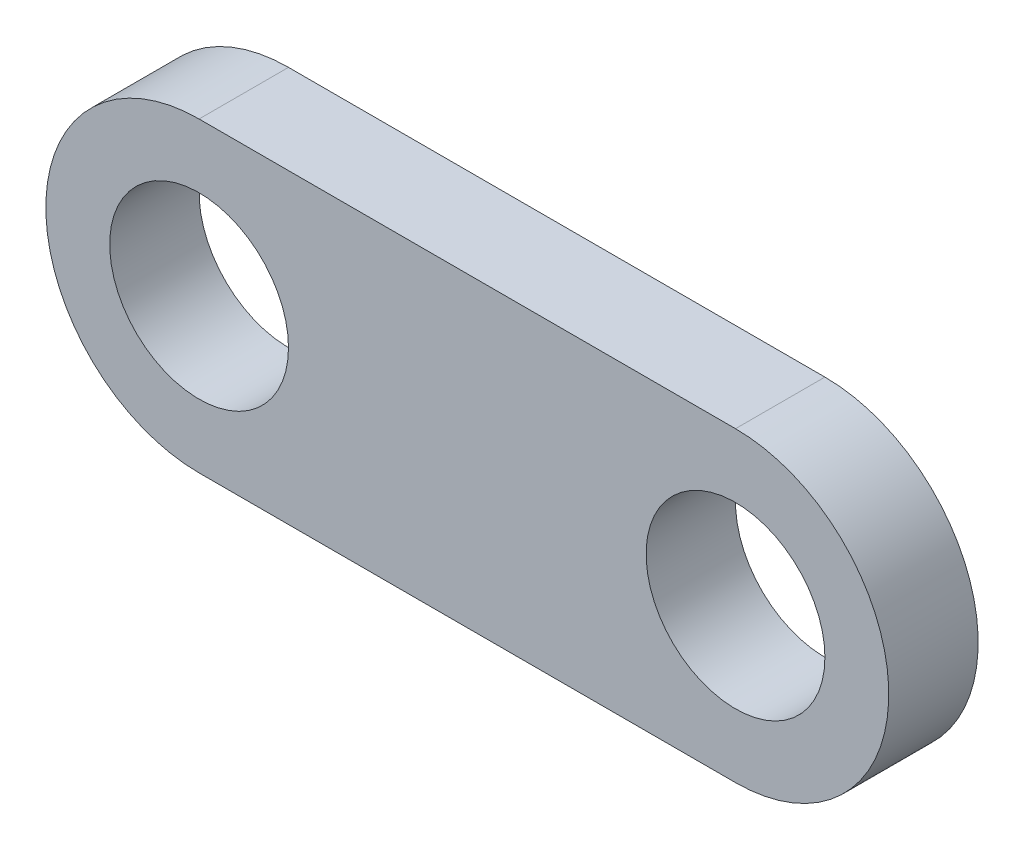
ISO-10303-21;
HEADER;
FILE_DESCRIPTION(('STEP AP214'),'2;1');
FILE_NAME('part.step','',(''),(''),'','','');
FILE_SCHEMA(('AUTOMOTIVE_DESIGN { 1 0 10303 214 1 1 1 1 }'));
ENDSEC;
DATA;
#1=APPLICATION_CONTEXT('core data for automotive mechanical design processes');
#2=APPLICATION_PROTOCOL_DEFINITION('international standard','automotive_design',2000,#1);
#3=PRODUCT_CONTEXT('',#1,'mechanical');
#4=PRODUCT('Part','Part','',(#3));
#5=PRODUCT_RELATED_PRODUCT_CATEGORY('part','',(#4));
#6=PRODUCT_DEFINITION_FORMATION('','',#4);
#7=PRODUCT_DEFINITION_CONTEXT('part definition',#1,'design');
#8=PRODUCT_DEFINITION('design','',#6,#7);
#9=PRODUCT_DEFINITION_SHAPE('','',#8);
#10=(LENGTH_UNIT() NAMED_UNIT(*) SI_UNIT(.MILLI.,.METRE.));
#11=(NAMED_UNIT(*) PLANE_ANGLE_UNIT() SI_UNIT($,.RADIAN.));
#12=(NAMED_UNIT(*) SI_UNIT($,.STERADIAN.) SOLID_ANGLE_UNIT());
#13=UNCERTAINTY_MEASURE_WITH_UNIT(LENGTH_MEASURE(1.E-05),#10,'distance_accuracy_value','');
#14=(GEOMETRIC_REPRESENTATION_CONTEXT(3) GLOBAL_UNCERTAINTY_ASSIGNED_CONTEXT((#13)) GLOBAL_UNIT_ASSIGNED_CONTEXT((#10,
#11,#12)) REPRESENTATION_CONTEXT('',''));
#15=CARTESIAN_POINT('',(0.,0.,0.));
#16=DIRECTION('',(0.,0.,1.));
#17=DIRECTION('',(1.,0.,0.));
#18=AXIS2_PLACEMENT_3D('',#15,#16,#17);
#19=CARTESIAN_POINT('',(0.,0.,7.));
#20=DIRECTION('',(0.,0.,-1.));
#21=DIRECTION('',(-1.,0.,0.));
#22=AXIS2_PLACEMENT_3D('',#19,#20,#21);
#23=CYLINDRICAL_SURFACE('',#22,12.);
#24=CARTESIAN_POINT('',(0.,0.,0.));
#25=DIRECTION('',(0.,0.,-1.));
#26=DIRECTION('',(-1.,0.,0.));
#27=AXIS2_PLACEMENT_3D('',#24,#25,#26);
#28=CIRCLE('',#27,12.);
#29=CARTESIAN_POINT('',(0.,-12.,0.));
#30=VERTEX_POINT('',#29);
#31=CARTESIAN_POINT('',(0.,12.,0.));
#32=VERTEX_POINT('',#31);
#33=EDGE_CURVE('E75',#30,#32,#28,.T.);
#34=ORIENTED_EDGE('',*,*,#33,.F.);
#35=DIRECTION('',(0.,0.,-1.));
#36=VECTOR('',#35,1.);
#37=CARTESIAN_POINT('',(0.,-12.,7.));
#38=LINE('',#37,#36);
#39=CARTESIAN_POINT('',(0.,-12.,7.));
#40=VERTEX_POINT('',#39);
#41=EDGE_CURVE('E11',#40,#30,#38,.T.);
#42=ORIENTED_EDGE('',*,*,#41,.F.);
#43=CARTESIAN_POINT('',(0.,0.,7.));
#44=DIRECTION('',(0.,0.,-1.));
#45=DIRECTION('',(-1.,0.,0.));
#46=AXIS2_PLACEMENT_3D('',#43,#44,#45);
#47=CIRCLE('',#46,12.);
#48=CARTESIAN_POINT('',(0.,12.,7.));
#49=VERTEX_POINT('',#48);
#50=EDGE_CURVE('E77',#40,#49,#47,.T.);
#51=ORIENTED_EDGE('',*,*,#50,.T.);
#52=DIRECTION('',(0.,0.,-1.));
#53=VECTOR('',#52,1.);
#54=CARTESIAN_POINT('',(0.,12.,7.));
#55=LINE('',#54,#53);
#56=EDGE_CURVE('E38',#49,#32,#55,.T.);
#57=ORIENTED_EDGE('',*,*,#56,.T.);
#58=EDGE_LOOP('',(#34,#42,#51,#57));
#59=FACE_BOUND('',#58,.T.);
#60=ADVANCED_FACE('F35',(#59),#23,.T.);
#61=CARTESIAN_POINT('',(42.,-12.,7.));
#62=DIRECTION('',(0.,-1.,0.));
#63=DIRECTION('',(0.,0.,-1.));
#64=AXIS2_PLACEMENT_3D('',#61,#62,#63);
#65=PLANE('',#64);
#66=DIRECTION('',(-1.,0.,0.));
#67=VECTOR('',#66,1.);
#68=CARTESIAN_POINT('',(42.,-12.,0.));
#69=LINE('',#68,#67);
#70=CARTESIAN_POINT('',(42.,-12.,0.));
#71=VERTEX_POINT('',#70);
#72=EDGE_CURVE('E92',#71,#30,#69,.T.);
#73=ORIENTED_EDGE('',*,*,#72,.F.);
#74=DIRECTION('',(0.,0.,-1.));
#75=VECTOR('',#74,1.);
#76=CARTESIAN_POINT('',(42.,-12.,7.));
#77=LINE('',#76,#75);
#78=CARTESIAN_POINT('',(42.,-12.,7.));
#79=VERTEX_POINT('',#78);
#80=EDGE_CURVE('E43',#79,#71,#77,.T.);
#81=ORIENTED_EDGE('',*,*,#80,.F.);
#82=DIRECTION('',(-1.,0.,0.));
#83=VECTOR('',#82,1.);
#84=CARTESIAN_POINT('',(42.,-12.,7.));
#85=LINE('',#84,#83);
#86=EDGE_CURVE('E82',#79,#40,#85,.T.);
#87=ORIENTED_EDGE('',*,*,#86,.T.);
#88=ORIENTED_EDGE('',*,*,#41,.T.);
#89=EDGE_LOOP('',(#73,#81,#87,#88));
#90=FACE_BOUND('',#89,.T.);
#91=ADVANCED_FACE('F112',(#90),#65,.T.);
#92=CARTESIAN_POINT('',(42.,0.,7.));
#93=DIRECTION('',(0.,0.,-1.));
#94=DIRECTION('',(-1.,0.,0.));
#95=AXIS2_PLACEMENT_3D('',#92,#93,#94);
#96=CYLINDRICAL_SURFACE('',#95,12.);
#97=CARTESIAN_POINT('',(42.,0.,0.));
#98=DIRECTION('',(0.,0.,-1.));
#99=DIRECTION('',(-1.,0.,0.));
#100=AXIS2_PLACEMENT_3D('',#97,#98,#99);
#101=CIRCLE('',#100,12.);
#102=CARTESIAN_POINT('',(42.,12.,0.));
#103=VERTEX_POINT('',#102);
#104=EDGE_CURVE('E89',#103,#71,#101,.T.);
#105=ORIENTED_EDGE('',*,*,#104,.F.);
#106=DIRECTION('',(0.,0.,-1.));
#107=VECTOR('',#106,1.);
#108=CARTESIAN_POINT('',(42.,12.,7.));
#109=LINE('',#108,#107);
#110=CARTESIAN_POINT('',(42.,12.,7.));
#111=VERTEX_POINT('',#110);
#112=EDGE_CURVE('E81',#111,#103,#109,.T.);
#113=ORIENTED_EDGE('',*,*,#112,.F.);
#114=CARTESIAN_POINT('',(42.,0.,7.));
#115=DIRECTION('',(0.,0.,-1.));
#116=DIRECTION('',(-1.,0.,0.));
#117=AXIS2_PLACEMENT_3D('',#114,#115,#116);
#118=CIRCLE('',#117,12.);
#119=EDGE_CURVE('E105',#111,#79,#118,.T.);
#120=ORIENTED_EDGE('',*,*,#119,.T.);
#121=ORIENTED_EDGE('',*,*,#80,.T.);
#122=EDGE_LOOP('',(#105,#113,#120,#121));
#123=FACE_BOUND('',#122,.T.);
#124=ADVANCED_FACE('F109',(#123),#96,.T.);
#125=CARTESIAN_POINT('',(0.,12.,7.));
#126=DIRECTION('',(0.,1.,0.));
#127=DIRECTION('',(0.,0.,1.));
#128=AXIS2_PLACEMENT_3D('',#125,#126,#127);
#129=PLANE('',#128);
#130=DIRECTION('',(1.,0.,0.));
#131=VECTOR('',#130,1.);
#132=CARTESIAN_POINT('',(0.,12.,0.));
#133=LINE('',#132,#131);
#134=EDGE_CURVE('E84',#32,#103,#133,.T.);
#135=ORIENTED_EDGE('',*,*,#134,.F.);
#136=ORIENTED_EDGE('',*,*,#56,.F.);
#137=DIRECTION('',(1.,0.,0.));
#138=VECTOR('',#137,1.);
#139=CARTESIAN_POINT('',(0.,12.,7.));
#140=LINE('',#139,#138);
#141=EDGE_CURVE('E103',#49,#111,#140,.T.);
#142=ORIENTED_EDGE('',*,*,#141,.T.);
#143=ORIENTED_EDGE('',*,*,#112,.T.);
#144=EDGE_LOOP('',(#135,#136,#142,#143));
#145=FACE_BOUND('',#144,.T.);
#146=ADVANCED_FACE('F85',(#145),#129,.T.);
#147=CARTESIAN_POINT('',(0.,0.,7.));
#148=DIRECTION('',(0.,0.,-1.));
#149=DIRECTION('',(-1.,0.,0.));
#150=AXIS2_PLACEMENT_3D('',#147,#148,#149);
#151=PLANE('',#150);
#152=CARTESIAN_POINT('',(0.,0.,7.));
#153=DIRECTION('',(0.,0.,-1.));
#154=DIRECTION('',(1.,0.,0.));
#155=AXIS2_PLACEMENT_3D('',#152,#153,#154);
#156=CIRCLE('',#155,7.);
#157=CARTESIAN_POINT('',(7.,0.,7.));
#158=VERTEX_POINT('',#157);
#159=EDGE_CURVE('E177',#158,#158,#156,.T.);
#160=ORIENTED_EDGE('',*,*,#159,.T.);
#161=EDGE_LOOP('',(#160));
#162=FACE_BOUND('',#161,.T.);
#163=CARTESIAN_POINT('',(42.,0.,7.));
#164=DIRECTION('',(0.,0.,-1.));
#165=DIRECTION('',(1.,0.,0.));
#166=AXIS2_PLACEMENT_3D('',#163,#164,#165);
#167=CIRCLE('',#166,7.);
#168=CARTESIAN_POINT('',(49.,0.,7.));
#169=VERTEX_POINT('',#168);
#170=EDGE_CURVE('E93',#169,#169,#167,.T.);
#171=ORIENTED_EDGE('',*,*,#170,.T.);
#172=EDGE_LOOP('',(#171));
#173=FACE_BOUND('',#172,.T.);
#174=ORIENTED_EDGE('',*,*,#50,.F.);
#175=ORIENTED_EDGE('',*,*,#86,.F.);
#176=ORIENTED_EDGE('',*,*,#119,.F.);
#177=ORIENTED_EDGE('',*,*,#141,.F.);
#178=EDGE_LOOP('',(#174,#175,#176,#177));
#179=FACE_BOUND('',#178,.T.);
#180=ADVANCED_FACE('F114',(#162,#173,#179),#151,.F.);
#181=CARTESIAN_POINT('',(0.,0.,0.));
#182=DIRECTION('',(0.,0.,-1.));
#183=DIRECTION('',(-1.,0.,0.));
#184=AXIS2_PLACEMENT_3D('',#181,#182,#183);
#185=PLANE('',#184);
#186=CARTESIAN_POINT('',(0.,0.,0.));
#187=DIRECTION('',(0.,0.,-1.));
#188=DIRECTION('',(1.,0.,0.));
#189=AXIS2_PLACEMENT_3D('',#186,#187,#188);
#190=CIRCLE('',#189,7.);
#191=CARTESIAN_POINT('',(7.,0.,0.));
#192=VERTEX_POINT('',#191);
#193=EDGE_CURVE('E180',#192,#192,#190,.T.);
#194=ORIENTED_EDGE('',*,*,#193,.F.);
#195=EDGE_LOOP('',(#194));
#196=FACE_BOUND('',#195,.T.);
#197=CARTESIAN_POINT('',(42.,0.,0.));
#198=DIRECTION('',(0.,0.,-1.));
#199=DIRECTION('',(1.,0.,0.));
#200=AXIS2_PLACEMENT_3D('',#197,#198,#199);
#201=CIRCLE('',#200,7.);
#202=CARTESIAN_POINT('',(49.,0.,0.));
#203=VERTEX_POINT('',#202);
#204=EDGE_CURVE('E96',#203,#203,#201,.T.);
#205=ORIENTED_EDGE('',*,*,#204,.F.);
#206=EDGE_LOOP('',(#205));
#207=FACE_BOUND('',#206,.T.);
#208=ORIENTED_EDGE('',*,*,#33,.T.);
#209=ORIENTED_EDGE('',*,*,#134,.T.);
#210=ORIENTED_EDGE('',*,*,#104,.T.);
#211=ORIENTED_EDGE('',*,*,#72,.T.);
#212=EDGE_LOOP('',(#208,#209,#210,#211));
#213=FACE_BOUND('',#212,.T.);
#214=ADVANCED_FACE('F91',(#196,#207,#213),#185,.T.);
#215=CARTESIAN_POINT('',(42.,0.,7.));
#216=DIRECTION('',(0.,0.,-1.));
#217=DIRECTION('',(-1.,0.,0.));
#218=AXIS2_PLACEMENT_3D('',#215,#216,#217);
#219=CYLINDRICAL_SURFACE('',#218,7.);
#220=ORIENTED_EDGE('',*,*,#170,.F.);
#221=EDGE_LOOP('',(#220));
#222=FACE_BOUND('',#221,.T.);
#223=ORIENTED_EDGE('',*,*,#204,.T.);
#224=EDGE_LOOP('',(#223));
#225=FACE_BOUND('',#224,.T.);
#226=ADVANCED_FACE('F122',(#222,#225),#219,.F.);
#227=CARTESIAN_POINT('',(0.,0.,7.));
#228=DIRECTION('',(0.,0.,-1.));
#229=DIRECTION('',(-1.,0.,0.));
#230=AXIS2_PLACEMENT_3D('',#227,#228,#229);
#231=CYLINDRICAL_SURFACE('',#230,7.);
#232=ORIENTED_EDGE('',*,*,#159,.F.);
#233=EDGE_LOOP('',(#232));
#234=FACE_BOUND('',#233,.T.);
#235=ORIENTED_EDGE('',*,*,#193,.T.);
#236=EDGE_LOOP('',(#235));
#237=FACE_BOUND('',#236,.T.);
#238=ADVANCED_FACE('F161',(#234,#237),#231,.F.);
#239=CLOSED_SHELL('',(#60,#91,#124,#146,#180,#214,#226,#238));
#240=MANIFOLD_SOLID_BREP('B2',#239);
#241=ADVANCED_BREP_SHAPE_REPRESENTATION('',(#18,#240),#14);
#242=SHAPE_DEFINITION_REPRESENTATION(#9,#241);
ENDSEC;
END-ISO-10303-21;
